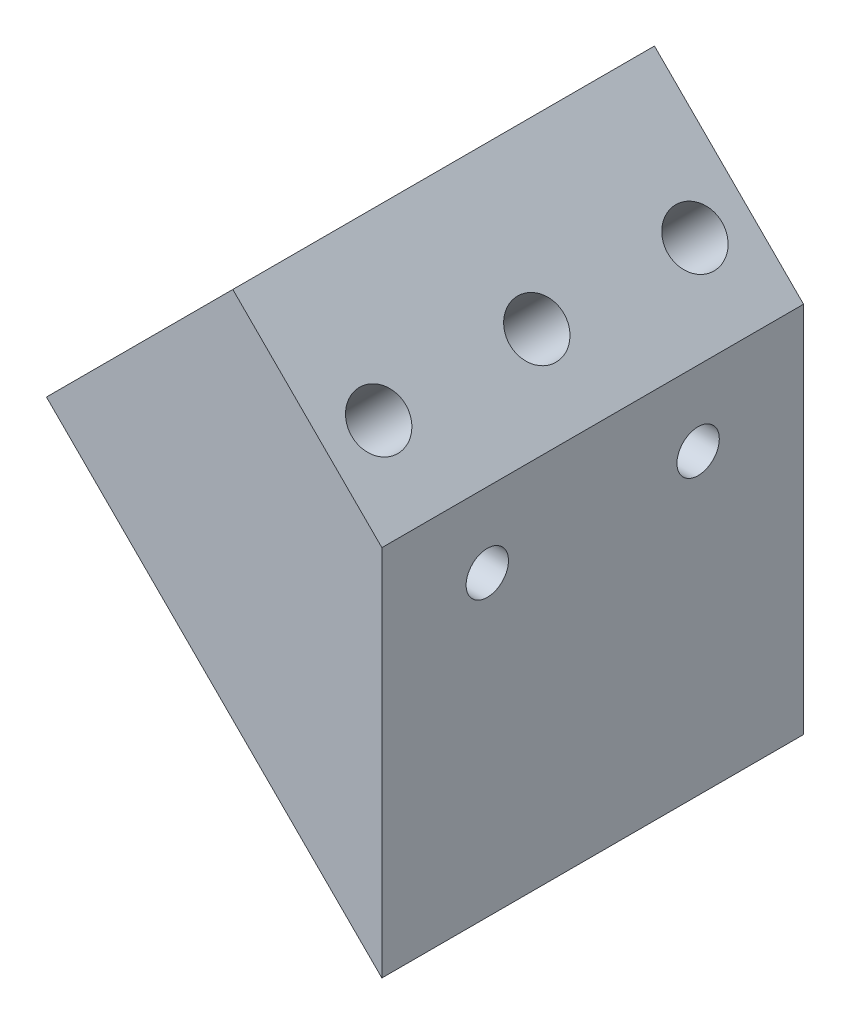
from build123d import *

# Parameters (mm, degrees)
BOSS_EXTRUDE1_DEPTH     = 25.4
F_1_4_20_TAPPED_HOLE1_D = 5.1054
CUT_EXTRUDE1_DEPTH      = 104.662656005
F_1_4_CLEARANCE_HOLE1_D = 6.5278


with BuildPart() as part:
    # Sketch1 → Boss-Extrude1 (new, symmetric)
    with BuildSketch(Plane.XY):
        Polygon((0, 0), (-40.411152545, 40.411152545), (0, 80.82230509), align=None)
    extrude(amount=BOSS_EXTRUDE1_DEPTH, both=True)

    # 1_4-20 Tapped Hole1 (through all)
    with Locations(Plane(origin=(0, 0, 0), x_dir=(0, 0, -1), z_dir=(1, 0, 0))):
        with Locations((-12.7, 35.92068), (12.7, 35.92068)):
            Hole(F_1_4_20_TAPPED_HOLE1_D / 2)

    # Sketch6 → Cut-Extrude1 (cut, through all)
    with BuildSketch(Plane.XY.offset(25.4)):
        Polygon((-17.960512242, 62.861792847), (0, 44.901280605), (0, 80.82230509), align=None)
    extrude(amount=-CUT_EXTRUDE1_DEPTH, mode=Mode.SUBTRACT)

    # 1_4 Clearance Hole1 (through all)
    with Locations(Plane(origin=(22.450640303, 22.450640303, 0), x_dir=(0, 0, -1), z_dir=(0.7071067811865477, 0.7071067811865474, 0))):
        with Locations((-19.05, 41.275), (19.05, 41.275), (0, 41.275)):
            Hole(F_1_4_CLEARANCE_HOLE1_D / 2)


solid = part.part
